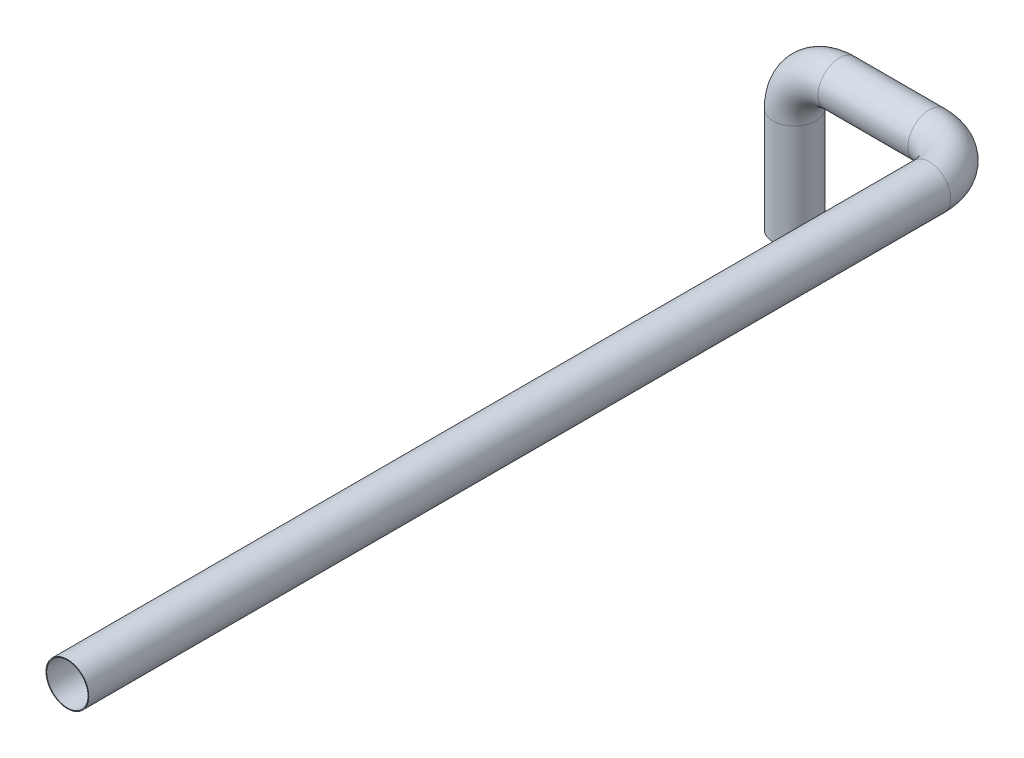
ISO-10303-21;
HEADER;
FILE_DESCRIPTION(('STEP AP214'),'2;1');
FILE_NAME('part.step','',(''),(''),'','','');
FILE_SCHEMA(('AUTOMOTIVE_DESIGN { 1 0 10303 214 1 1 1 1 }'));
ENDSEC;
DATA;
#1=APPLICATION_CONTEXT('core data for automotive mechanical design processes');
#2=APPLICATION_PROTOCOL_DEFINITION('international standard','automotive_design',2000,#1);
#3=PRODUCT_CONTEXT('',#1,'mechanical');
#4=PRODUCT('Part','Part','',(#3));
#5=PRODUCT_RELATED_PRODUCT_CATEGORY('part','',(#4));
#6=PRODUCT_DEFINITION_FORMATION('','',#4);
#7=PRODUCT_DEFINITION_CONTEXT('part definition',#1,'design');
#8=PRODUCT_DEFINITION('design','',#6,#7);
#9=PRODUCT_DEFINITION_SHAPE('','',#8);
#10=(LENGTH_UNIT() NAMED_UNIT(*) SI_UNIT(.MILLI.,.METRE.));
#11=(NAMED_UNIT(*) PLANE_ANGLE_UNIT() SI_UNIT($,.RADIAN.));
#12=(NAMED_UNIT(*) SI_UNIT($,.STERADIAN.) SOLID_ANGLE_UNIT());
#13=UNCERTAINTY_MEASURE_WITH_UNIT(LENGTH_MEASURE(1.E-05),#10,'distance_accuracy_value','');
#14=(GEOMETRIC_REPRESENTATION_CONTEXT(3) GLOBAL_UNCERTAINTY_ASSIGNED_CONTEXT((#13)) GLOBAL_UNIT_ASSIGNED_CONTEXT((#10,
#11,#12)) REPRESENTATION_CONTEXT('',''));
#15=CARTESIAN_POINT('',(0.,0.,0.));
#16=DIRECTION('',(0.,0.,1.));
#17=DIRECTION('',(1.,0.,0.));
#18=AXIS2_PLACEMENT_3D('',#15,#16,#17);
#19=CARTESIAN_POINT('',(0.,-30.,0.));
#20=DIRECTION('',(0.,-1.,0.));
#21=DIRECTION('',(0.,0.,-1.));
#22=AXIS2_PLACEMENT_3D('',#19,#20,#21);
#23=CYLINDRICAL_SURFACE('',#22,14.3);
#24=CARTESIAN_POINT('',(0.,-30.,0.));
#25=DIRECTION('',(0.,1.,0.));
#26=DIRECTION('',(0.,0.,-1.));
#27=AXIS2_PLACEMENT_3D('',#24,#25,#26);
#28=CIRCLE('',#27,14.3);
#29=CARTESIAN_POINT('',(-14.3,-30.,0.));
#30=VERTEX_POINT('',#29);
#31=EDGE_CURVE('E49',#30,#30,#28,.T.);
#32=ORIENTED_EDGE('',*,*,#31,.F.);
#33=EDGE_LOOP('',(#32));
#34=FACE_BOUND('',#33,.T.);
#35=CARTESIAN_POINT('',(0.,-100.,0.));
#36=DIRECTION('',(0.,1.,0.));
#37=DIRECTION('',(0.,0.,-1.));
#38=AXIS2_PLACEMENT_3D('',#35,#36,#37);
#39=CIRCLE('',#38,14.3);
#40=CARTESIAN_POINT('',(0.,-100.,-14.3));
#41=VERTEX_POINT('',#40);
#42=EDGE_CURVE('E12',#41,#41,#39,.T.);
#43=ORIENTED_EDGE('',*,*,#42,.T.);
#44=EDGE_LOOP('',(#43));
#45=FACE_BOUND('',#44,.T.);
#46=ADVANCED_FACE('F39',(#34,#45),#23,.T.);
#47=CARTESIAN_POINT('',(0.,-30.,0.));
#48=DIRECTION('',(0.,-1.,0.));
#49=DIRECTION('',(0.,0.,-1.));
#50=AXIS2_PLACEMENT_3D('',#47,#48,#49);
#51=CYLINDRICAL_SURFACE('',#50,13.8);
#52=CARTESIAN_POINT('',(0.,-30.,0.));
#53=DIRECTION('',(0.,1.,0.));
#54=DIRECTION('',(0.,0.,-1.));
#55=AXIS2_PLACEMENT_3D('',#52,#53,#54);
#56=CIRCLE('',#55,13.8);
#57=CARTESIAN_POINT('',(-13.8,-30.,0.));
#58=VERTEX_POINT('',#57);
#59=EDGE_CURVE('E53',#58,#58,#56,.T.);
#60=ORIENTED_EDGE('',*,*,#59,.T.);
#61=EDGE_LOOP('',(#60));
#62=FACE_BOUND('',#61,.T.);
#63=CARTESIAN_POINT('',(0.,-100.,0.));
#64=DIRECTION('',(0.,1.,0.));
#65=DIRECTION('',(0.,0.,-1.));
#66=AXIS2_PLACEMENT_3D('',#63,#64,#65);
#67=CIRCLE('',#66,13.8);
#68=CARTESIAN_POINT('',(0.,-100.,-13.8));
#69=VERTEX_POINT('',#68);
#70=EDGE_CURVE('E45',#69,#69,#67,.T.);
#71=ORIENTED_EDGE('',*,*,#70,.F.);
#72=EDGE_LOOP('',(#71));
#73=FACE_BOUND('',#72,.T.);
#74=ADVANCED_FACE('F108',(#62,#73),#51,.F.);
#75=CARTESIAN_POINT('',(30.,-30.,0.));
#76=DIRECTION('',(0.,0.,1.));
#77=DIRECTION('',(1.,0.,0.));
#78=AXIS2_PLACEMENT_3D('',#75,#76,#77);
#79=TOROIDAL_SURFACE('',#78,30.,14.3);
#80=CARTESIAN_POINT('',(30.,0.,0.));
#81=DIRECTION('',(1.,0.,0.));
#82=DIRECTION('',(0.,0.,-1.));
#83=AXIS2_PLACEMENT_3D('',#80,#81,#82);
#84=CIRCLE('',#83,14.3);
#85=CARTESIAN_POINT('',(30.,14.3,0.));
#86=VERTEX_POINT('',#85);
#87=EDGE_CURVE('E58',#86,#86,#84,.T.);
#88=CARTESIAN_POINT('',(30.,-30.,0.));
#89=DIRECTION('',(0.,0.,1.));
#90=DIRECTION('',(1.,0.,0.));
#91=AXIS2_PLACEMENT_3D('',#88,#89,#90);
#92=CIRCLE('',#91,44.3);
#93=EDGE_CURVE('',#86,#30,#92,.T.);
#94=ORIENTED_EDGE('',*,*,#87,.F.);
#95=ORIENTED_EDGE('',*,*,#31,.T.);
#96=ORIENTED_EDGE('',*,*,#93,.T.);
#97=ORIENTED_EDGE('',*,*,#93,.F.);
#98=EDGE_LOOP('',(#94,#96,#95,#97));
#99=FACE_BOUND('',#98,.T.);
#100=ADVANCED_FACE('F113',(#99),#79,.T.);
#101=CARTESIAN_POINT('',(30.,-30.,0.));
#102=DIRECTION('',(0.,0.,1.));
#103=DIRECTION('',(1.,0.,0.));
#104=AXIS2_PLACEMENT_3D('',#101,#102,#103);
#105=TOROIDAL_SURFACE('',#104,30.,13.8);
#106=CARTESIAN_POINT('',(30.,0.,0.));
#107=DIRECTION('',(1.,0.,0.));
#108=DIRECTION('',(0.,0.,-1.));
#109=AXIS2_PLACEMENT_3D('',#106,#107,#108);
#110=CIRCLE('',#109,13.8);
#111=CARTESIAN_POINT('',(30.,13.8,0.));
#112=VERTEX_POINT('',#111);
#113=EDGE_CURVE('E61',#112,#112,#110,.T.);
#114=CARTESIAN_POINT('',(30.,-30.,0.));
#115=DIRECTION('',(0.,0.,1.));
#116=DIRECTION('',(1.,0.,0.));
#117=AXIS2_PLACEMENT_3D('',#114,#115,#116);
#118=CIRCLE('',#117,43.8);
#119=EDGE_CURVE('',#112,#58,#118,.T.);
#120=ORIENTED_EDGE('',*,*,#113,.T.);
#121=ORIENTED_EDGE('',*,*,#59,.F.);
#122=ORIENTED_EDGE('',*,*,#119,.T.);
#123=ORIENTED_EDGE('',*,*,#119,.F.);
#124=EDGE_LOOP('',(#120,#122,#121,#123));
#125=FACE_BOUND('',#124,.T.);
#126=ADVANCED_FACE('F118',(#125),#105,.F.);
#127=CARTESIAN_POINT('',(90.,0.,0.));
#128=DIRECTION('',(-1.,0.,0.));
#129=DIRECTION('',(0.,0.,1.));
#130=AXIS2_PLACEMENT_3D('',#127,#128,#129);
#131=CYLINDRICAL_SURFACE('',#130,14.3);
#132=CARTESIAN_POINT('',(90.,0.,0.));
#133=DIRECTION('',(1.,0.,0.));
#134=DIRECTION('',(0.,0.,-1.));
#135=AXIS2_PLACEMENT_3D('',#132,#133,#134);
#136=CIRCLE('',#135,14.3);
#137=CARTESIAN_POINT('',(90.,0.,-14.3));
#138=VERTEX_POINT('',#137);
#139=EDGE_CURVE('E64',#138,#138,#136,.T.);
#140=ORIENTED_EDGE('',*,*,#139,.F.);
#141=EDGE_LOOP('',(#140));
#142=FACE_BOUND('',#141,.T.);
#143=ORIENTED_EDGE('',*,*,#87,.T.);
#144=EDGE_LOOP('',(#143));
#145=FACE_BOUND('',#144,.T.);
#146=ADVANCED_FACE('F124',(#142,#145),#131,.T.);
#147=CARTESIAN_POINT('',(90.,0.,0.));
#148=DIRECTION('',(-1.,0.,0.));
#149=DIRECTION('',(0.,0.,1.));
#150=AXIS2_PLACEMENT_3D('',#147,#148,#149);
#151=CYLINDRICAL_SURFACE('',#150,13.8);
#152=CARTESIAN_POINT('',(90.,0.,0.));
#153=DIRECTION('',(1.,0.,0.));
#154=DIRECTION('',(0.,0.,-1.));
#155=AXIS2_PLACEMENT_3D('',#152,#153,#154);
#156=CIRCLE('',#155,13.8);
#157=CARTESIAN_POINT('',(90.,0.,-13.8));
#158=VERTEX_POINT('',#157);
#159=EDGE_CURVE('E67',#158,#158,#156,.T.);
#160=ORIENTED_EDGE('',*,*,#159,.T.);
#161=EDGE_LOOP('',(#160));
#162=FACE_BOUND('',#161,.T.);
#163=ORIENTED_EDGE('',*,*,#113,.F.);
#164=EDGE_LOOP('',(#163));
#165=FACE_BOUND('',#164,.T.);
#166=ADVANCED_FACE('F131',(#162,#165),#151,.F.);
#167=CARTESIAN_POINT('',(90.,0.,30.));
#168=DIRECTION('',(0.,1.,0.));
#169=DIRECTION('',(0.,0.,1.));
#170=AXIS2_PLACEMENT_3D('',#167,#168,#169);
#171=TOROIDAL_SURFACE('',#170,30.,14.3);
#172=CARTESIAN_POINT('',(120.,0.,30.));
#173=DIRECTION('',(0.,0.,1.));
#174=DIRECTION('',(1.,0.,0.));
#175=AXIS2_PLACEMENT_3D('',#172,#173,#174);
#176=CIRCLE('',#175,14.3);
#177=CARTESIAN_POINT('',(134.3,0.,30.));
#178=VERTEX_POINT('',#177);
#179=EDGE_CURVE('E70',#178,#178,#176,.T.);
#180=CARTESIAN_POINT('',(90.,0.,30.));
#181=DIRECTION('',(0.,1.,0.));
#182=DIRECTION('',(0.,0.,1.));
#183=AXIS2_PLACEMENT_3D('',#180,#181,#182);
#184=CIRCLE('',#183,44.3);
#185=EDGE_CURVE('',#178,#138,#184,.T.);
#186=ORIENTED_EDGE('',*,*,#179,.F.);
#187=ORIENTED_EDGE('',*,*,#139,.T.);
#188=ORIENTED_EDGE('',*,*,#185,.T.);
#189=ORIENTED_EDGE('',*,*,#185,.F.);
#190=EDGE_LOOP('',(#186,#188,#187,#189));
#191=FACE_BOUND('',#190,.T.);
#192=ADVANCED_FACE('F135',(#191),#171,.T.);
#193=CARTESIAN_POINT('',(90.,0.,30.));
#194=DIRECTION('',(0.,1.,0.));
#195=DIRECTION('',(0.,0.,1.));
#196=AXIS2_PLACEMENT_3D('',#193,#194,#195);
#197=TOROIDAL_SURFACE('',#196,30.,13.8);
#198=CARTESIAN_POINT('',(120.,0.,30.));
#199=DIRECTION('',(0.,0.,1.));
#200=DIRECTION('',(1.,0.,0.));
#201=AXIS2_PLACEMENT_3D('',#198,#199,#200);
#202=CIRCLE('',#201,13.8);
#203=CARTESIAN_POINT('',(133.8,0.,30.));
#204=VERTEX_POINT('',#203);
#205=EDGE_CURVE('E74',#204,#204,#202,.T.);
#206=CARTESIAN_POINT('',(90.,0.,30.));
#207=DIRECTION('',(0.,1.,0.));
#208=DIRECTION('',(0.,0.,1.));
#209=AXIS2_PLACEMENT_3D('',#206,#207,#208);
#210=CIRCLE('',#209,43.8);
#211=EDGE_CURVE('',#204,#158,#210,.T.);
#212=ORIENTED_EDGE('',*,*,#205,.T.);
#213=ORIENTED_EDGE('',*,*,#159,.F.);
#214=ORIENTED_EDGE('',*,*,#211,.T.);
#215=ORIENTED_EDGE('',*,*,#211,.F.);
#216=EDGE_LOOP('',(#212,#214,#213,#215));
#217=FACE_BOUND('',#216,.T.);
#218=ADVANCED_FACE('F83',(#217),#197,.F.);
#219=CARTESIAN_POINT('',(120.,0.,30.));
#220=DIRECTION('',(0.,0.,1.));
#221=DIRECTION('',(1.,0.,0.));
#222=AXIS2_PLACEMENT_3D('',#219,#220,#221);
#223=CYLINDRICAL_SURFACE('',#222,13.8);
#224=ORIENTED_EDGE('',*,*,#205,.F.);
#225=EDGE_LOOP('',(#224));
#226=FACE_BOUND('',#225,.T.);
#227=CARTESIAN_POINT('',(120.,0.,605.8));
#228=DIRECTION('',(0.,0.,1.));
#229=DIRECTION('',(1.,0.,0.));
#230=AXIS2_PLACEMENT_3D('',#227,#228,#229);
#231=CIRCLE('',#230,13.8);
#232=CARTESIAN_POINT('',(133.8,0.,605.8));
#233=VERTEX_POINT('',#232);
#234=EDGE_CURVE('E75',#233,#233,#231,.T.);
#235=ORIENTED_EDGE('',*,*,#234,.T.);
#236=EDGE_LOOP('',(#235));
#237=FACE_BOUND('',#236,.T.);
#238=ADVANCED_FACE('F86',(#226,#237),#223,.F.);
#239=CARTESIAN_POINT('',(120.,0.,30.));
#240=DIRECTION('',(0.,0.,1.));
#241=DIRECTION('',(1.,0.,0.));
#242=AXIS2_PLACEMENT_3D('',#239,#240,#241);
#243=CYLINDRICAL_SURFACE('',#242,14.3);
#244=ORIENTED_EDGE('',*,*,#179,.T.);
#245=EDGE_LOOP('',(#244));
#246=FACE_BOUND('',#245,.T.);
#247=CARTESIAN_POINT('',(120.,0.,605.8));
#248=DIRECTION('',(0.,0.,1.));
#249=DIRECTION('',(1.,0.,0.));
#250=AXIS2_PLACEMENT_3D('',#247,#248,#249);
#251=CIRCLE('',#250,14.3);
#252=CARTESIAN_POINT('',(134.3,0.,605.8));
#253=VERTEX_POINT('',#252);
#254=EDGE_CURVE('E71',#253,#253,#251,.T.);
#255=ORIENTED_EDGE('',*,*,#254,.F.);
#256=EDGE_LOOP('',(#255));
#257=FACE_BOUND('',#256,.T.);
#258=ADVANCED_FACE('F89',(#246,#257),#243,.T.);
#259=CARTESIAN_POINT('',(0.,-100.,0.));
#260=DIRECTION('',(0.,1.,0.));
#261=DIRECTION('',(0.,0.,-1.));
#262=AXIS2_PLACEMENT_3D('',#259,#260,#261);
#263=PLANE('',#262);
#264=ORIENTED_EDGE('',*,*,#70,.T.);
#265=EDGE_LOOP('',(#264));
#266=FACE_BOUND('',#265,.T.);
#267=ORIENTED_EDGE('',*,*,#42,.F.);
#268=EDGE_LOOP('',(#267));
#269=FACE_BOUND('',#268,.T.);
#270=ADVANCED_FACE('F96',(#266,#269),#263,.F.);
#271=CARTESIAN_POINT('',(120.,0.,605.8));
#272=DIRECTION('',(0.,0.,1.));
#273=DIRECTION('',(1.,0.,0.));
#274=AXIS2_PLACEMENT_3D('',#271,#272,#273);
#275=PLANE('',#274);
#276=ORIENTED_EDGE('',*,*,#234,.F.);
#277=EDGE_LOOP('',(#276));
#278=FACE_BOUND('',#277,.T.);
#279=ORIENTED_EDGE('',*,*,#254,.T.);
#280=EDGE_LOOP('',(#279));
#281=FACE_BOUND('',#280,.T.);
#282=ADVANCED_FACE('F93',(#278,#281),#275,.T.);
#283=CLOSED_SHELL('',(#46,#74,#100,#126,#146,#166,#192,#218,#238,#258,#270,#282));
#284=MANIFOLD_SOLID_BREP('B2',#283);
#285=ADVANCED_BREP_SHAPE_REPRESENTATION('',(#18,#284),#14);
#286=SHAPE_DEFINITION_REPRESENTATION(#9,#285);
ENDSEC;
END-ISO-10303-21;
